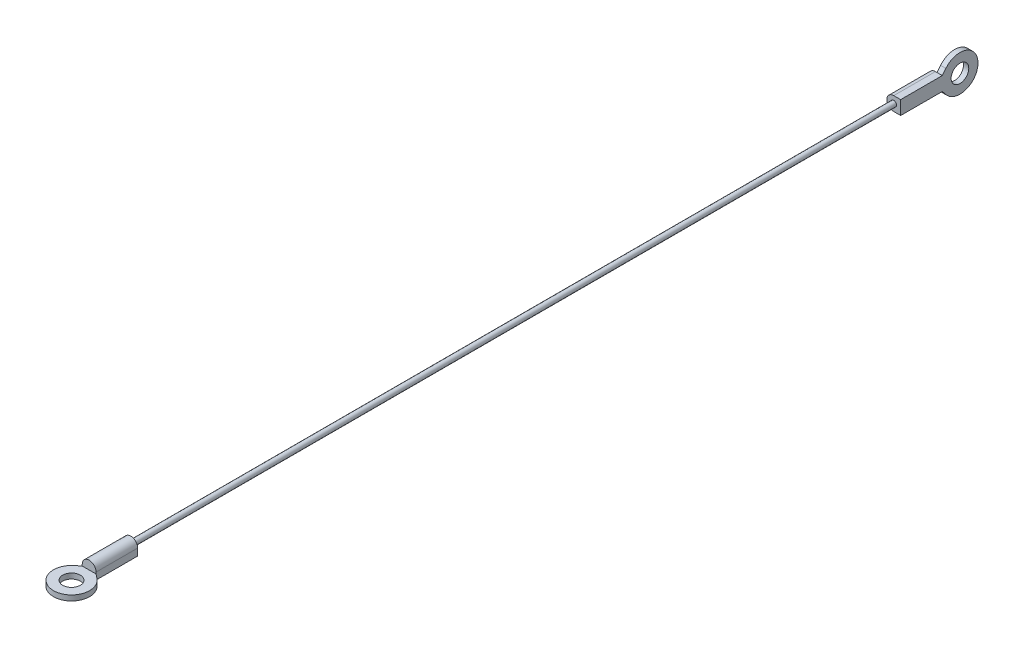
ISO-10303-21;
HEADER;
FILE_DESCRIPTION(('STEP AP214'),'2;1');
FILE_NAME('part.step','',(''),(''),'','','');
FILE_SCHEMA(('AUTOMOTIVE_DESIGN { 1 0 10303 214 1 1 1 1 }'));
ENDSEC;
DATA;
#1=APPLICATION_CONTEXT('core data for automotive mechanical design processes');
#2=APPLICATION_PROTOCOL_DEFINITION('international standard','automotive_design',2000,#1);
#3=PRODUCT_CONTEXT('',#1,'mechanical');
#4=PRODUCT('Part','Part','',(#3));
#5=PRODUCT_RELATED_PRODUCT_CATEGORY('part','',(#4));
#6=PRODUCT_DEFINITION_FORMATION('','',#4);
#7=PRODUCT_DEFINITION_CONTEXT('part definition',#1,'design');
#8=PRODUCT_DEFINITION('design','',#6,#7);
#9=PRODUCT_DEFINITION_SHAPE('','',#8);
#10=(LENGTH_UNIT() NAMED_UNIT(*) SI_UNIT(.MILLI.,.METRE.));
#11=(NAMED_UNIT(*) PLANE_ANGLE_UNIT() SI_UNIT($,.RADIAN.));
#12=(NAMED_UNIT(*) SI_UNIT($,.STERADIAN.) SOLID_ANGLE_UNIT());
#13=UNCERTAINTY_MEASURE_WITH_UNIT(LENGTH_MEASURE(1.E-05),#10,'distance_accuracy_value','');
#14=(GEOMETRIC_REPRESENTATION_CONTEXT(3) GLOBAL_UNCERTAINTY_ASSIGNED_CONTEXT((#13)) GLOBAL_UNIT_ASSIGNED_CONTEXT((#10,
#11,#12)) REPRESENTATION_CONTEXT('',''));
#15=CARTESIAN_POINT('',(0.,0.,0.));
#16=DIRECTION('',(0.,0.,1.));
#17=DIRECTION('',(1.,0.,0.));
#18=AXIS2_PLACEMENT_3D('',#15,#16,#17);
#19=CARTESIAN_POINT('',(0.,0.,-121.92));
#20=DIRECTION('',(0.,0.,-1.));
#21=DIRECTION('',(-1.,0.,0.));
#22=AXIS2_PLACEMENT_3D('',#19,#20,#21);
#23=PLANE('',#22);
#24=DIRECTION('',(1.,0.,0.));
#25=VECTOR('',#24,1.);
#26=CARTESIAN_POINT('',(0.,1.99,-121.92));
#27=LINE('',#26,#25);
#28=CARTESIAN_POINT('',(0.,1.99,-121.92));
#29=VERTEX_POINT('',#28);
#30=CARTESIAN_POINT('',(0.47,1.99,-121.92));
#31=VERTEX_POINT('',#30);
#32=EDGE_CURVE('E196',#29,#31,#27,.T.);
#33=ORIENTED_EDGE('',*,*,#32,.T.);
#34=DIRECTION('',(0.,-1.,0.));
#35=VECTOR('',#34,1.);
#36=CARTESIAN_POINT('',(0.47,-1.99,-121.92));
#37=LINE('',#36,#35);
#38=CARTESIAN_POINT('',(0.47,-1.99,-121.92));
#39=VERTEX_POINT('',#38);
#40=EDGE_CURVE('E154',#31,#39,#37,.T.);
#41=ORIENTED_EDGE('',*,*,#40,.T.);
#42=DIRECTION('',(-1.,0.,0.));
#43=VECTOR('',#42,1.);
#44=CARTESIAN_POINT('',(1.99,-1.99,-121.92));
#45=LINE('',#44,#43);
#46=CARTESIAN_POINT('',(0.,-1.99,-121.92));
#47=VERTEX_POINT('',#46);
#48=EDGE_CURVE('E201',#39,#47,#45,.T.);
#49=ORIENTED_EDGE('',*,*,#48,.T.);
#50=CARTESIAN_POINT('',(0.,0.,-121.92));
#51=DIRECTION('',(0.,0.,-1.));
#52=DIRECTION('',(-1.,0.,0.));
#53=AXIS2_PLACEMENT_3D('',#50,#51,#52);
#54=CIRCLE('',#53,1.99);
#55=EDGE_CURVE('E193',#47,#29,#54,.T.);
#56=ORIENTED_EDGE('',*,*,#55,.T.);
#57=EDGE_LOOP('',(#33,#41,#49,#56));
#58=FACE_BOUND('',#57,.T.);
#59=ADVANCED_FACE('F39',(#58),#23,.T.);
#60=CARTESIAN_POINT('',(0.,0.,121.92));
#61=DIRECTION('',(0.,0.,1.));
#62=DIRECTION('',(1.,0.,0.));
#63=AXIS2_PLACEMENT_3D('',#60,#61,#62);
#64=PLANE('',#63);
#65=DIRECTION('',(0.,-1.,0.));
#66=VECTOR('',#65,1.);
#67=CARTESIAN_POINT('',(-1.99,0.,121.92));
#68=LINE('',#67,#66);
#69=CARTESIAN_POINT('',(-1.99,0.,121.92));
#70=VERTEX_POINT('',#69);
#71=CARTESIAN_POINT('',(-1.99,-0.47,121.92));
#72=VERTEX_POINT('',#71);
#73=EDGE_CURVE('E279',#70,#72,#68,.T.);
#74=ORIENTED_EDGE('',*,*,#73,.T.);
#75=DIRECTION('',(1.,0.,0.));
#76=VECTOR('',#75,1.);
#77=CARTESIAN_POINT('',(-1.99,-0.47,121.92));
#78=LINE('',#77,#76);
#79=CARTESIAN_POINT('',(1.99,-0.47,121.92));
#80=VERTEX_POINT('',#79);
#81=EDGE_CURVE('E240',#72,#80,#78,.T.);
#82=ORIENTED_EDGE('',*,*,#81,.T.);
#83=DIRECTION('',(0.,1.,0.));
#84=VECTOR('',#83,1.);
#85=CARTESIAN_POINT('',(1.99,-1.99,121.92));
#86=LINE('',#85,#84);
#87=CARTESIAN_POINT('',(1.99,0.,121.92));
#88=VERTEX_POINT('',#87);
#89=EDGE_CURVE('E284',#80,#88,#86,.T.);
#90=ORIENTED_EDGE('',*,*,#89,.T.);
#91=CARTESIAN_POINT('',(0.,0.,121.92));
#92=DIRECTION('',(0.,0.,1.));
#93=DIRECTION('',(1.,0.,0.));
#94=AXIS2_PLACEMENT_3D('',#91,#92,#93);
#95=CIRCLE('',#94,1.99);
#96=EDGE_CURVE('E275',#88,#70,#95,.T.);
#97=ORIENTED_EDGE('',*,*,#96,.T.);
#98=EDGE_LOOP('',(#74,#82,#90,#97));
#99=FACE_BOUND('',#98,.T.);
#100=ADVANCED_FACE('F339',(#99),#64,.T.);
#101=CARTESIAN_POINT('',(0.,0.,109.92));
#102=DIRECTION('',(0.,0.,-1.));
#103=DIRECTION('',(-1.,0.,0.));
#104=AXIS2_PLACEMENT_3D('',#101,#102,#103);
#105=CYLINDRICAL_SURFACE('',#104,0.795);
#106=CARTESIAN_POINT('',(0.,0.,109.92));
#107=DIRECTION('',(0.,0.,1.));
#108=DIRECTION('',(1.,0.,0.));
#109=AXIS2_PLACEMENT_3D('',#106,#107,#108);
#110=CIRCLE('',#109,0.795);
#111=CARTESIAN_POINT('',(-0.795,0.,109.92));
#112=VERTEX_POINT('',#111);
#113=EDGE_CURVE('E11',#112,#112,#110,.T.);
#114=CARTESIAN_POINT('',(0.,0.,-109.92));
#115=DIRECTION('',(0.,0.,1.));
#116=DIRECTION('',(1.,0.,0.));
#117=AXIS2_PLACEMENT_3D('',#114,#115,#116);
#118=CIRCLE('',#117,0.795);
#119=CARTESIAN_POINT('',(-0.795,0.,-109.92));
#120=VERTEX_POINT('',#119);
#121=EDGE_CURVE('E43',#120,#120,#118,.T.);
#122=CARTESIAN_POINT('',(-0.795,0.,109.92));
#123=CARTESIAN_POINT('',(-0.795,0.,107.63));
#124=CARTESIAN_POINT('',(-0.795,0.,105.34));
#125=CARTESIAN_POINT('',(-0.795,0.,100.76));
#126=CARTESIAN_POINT('',(-0.795,0.,98.47));
#127=CARTESIAN_POINT('',(-0.795,0.,93.89));
#128=CARTESIAN_POINT('',(-0.795,0.,91.6));
#129=CARTESIAN_POINT('',(-0.795,0.,87.02));
#130=CARTESIAN_POINT('',(-0.795,0.,84.73));
#131=CARTESIAN_POINT('',(-0.795,0.,80.15));
#132=CARTESIAN_POINT('',(-0.795,0.,77.86));
#133=CARTESIAN_POINT('',(-0.795,0.,73.28));
#134=CARTESIAN_POINT('',(-0.795,0.,70.99));
#135=CARTESIAN_POINT('',(-0.795,0.,66.41));
#136=CARTESIAN_POINT('',(-0.795,0.,64.12));
#137=CARTESIAN_POINT('',(-0.795,0.,59.54));
#138=CARTESIAN_POINT('',(-0.795,0.,57.25));
#139=CARTESIAN_POINT('',(-0.795,0.,52.67));
#140=CARTESIAN_POINT('',(-0.795,0.,50.38));
#141=CARTESIAN_POINT('',(-0.795,0.,45.8));
#142=CARTESIAN_POINT('',(-0.795,0.,43.51));
#143=CARTESIAN_POINT('',(-0.795,0.,38.93));
#144=CARTESIAN_POINT('',(-0.795,0.,36.64));
#145=CARTESIAN_POINT('',(-0.795,0.,32.06));
#146=CARTESIAN_POINT('',(-0.795,0.,29.77));
#147=CARTESIAN_POINT('',(-0.795,0.,25.19));
#148=CARTESIAN_POINT('',(-0.795,0.,22.9));
#149=CARTESIAN_POINT('',(-0.795,0.,18.32));
#150=CARTESIAN_POINT('',(-0.795,0.,16.03));
#151=CARTESIAN_POINT('',(-0.795,0.,11.45));
#152=CARTESIAN_POINT('',(-0.795,0.,9.16));
#153=CARTESIAN_POINT('',(-0.795,0.,4.58));
#154=CARTESIAN_POINT('',(-0.795,0.,2.29));
#155=CARTESIAN_POINT('',(-0.795,0.,-2.29));
#156=CARTESIAN_POINT('',(-0.795,0.,-4.58));
#157=CARTESIAN_POINT('',(-0.795,0.,-9.16));
#158=CARTESIAN_POINT('',(-0.795,0.,-11.45));
#159=CARTESIAN_POINT('',(-0.795,0.,-16.03));
#160=CARTESIAN_POINT('',(-0.795,0.,-18.32));
#161=CARTESIAN_POINT('',(-0.795,0.,-22.9));
#162=CARTESIAN_POINT('',(-0.795,0.,-25.19));
#163=CARTESIAN_POINT('',(-0.795,0.,-29.77));
#164=CARTESIAN_POINT('',(-0.795,0.,-32.06));
#165=CARTESIAN_POINT('',(-0.795,0.,-36.64));
#166=CARTESIAN_POINT('',(-0.795,0.,-38.93));
#167=CARTESIAN_POINT('',(-0.795,0.,-43.51));
#168=CARTESIAN_POINT('',(-0.795,0.,-45.8));
#169=CARTESIAN_POINT('',(-0.795,0.,-50.38));
#170=CARTESIAN_POINT('',(-0.795,0.,-52.67));
#171=CARTESIAN_POINT('',(-0.795,0.,-57.25));
#172=CARTESIAN_POINT('',(-0.795,0.,-59.54));
#173=CARTESIAN_POINT('',(-0.795,0.,-64.12));
#174=CARTESIAN_POINT('',(-0.795,0.,-66.41));
#175=CARTESIAN_POINT('',(-0.795,0.,-70.99));
#176=CARTESIAN_POINT('',(-0.795,0.,-73.28));
#177=CARTESIAN_POINT('',(-0.795,0.,-77.86));
#178=CARTESIAN_POINT('',(-0.795,0.,-80.15));
#179=CARTESIAN_POINT('',(-0.795,0.,-84.73));
#180=CARTESIAN_POINT('',(-0.795,0.,-87.02));
#181=CARTESIAN_POINT('',(-0.795,0.,-91.6));
#182=CARTESIAN_POINT('',(-0.795,0.,-93.89));
#183=CARTESIAN_POINT('',(-0.795,0.,-98.47));
#184=CARTESIAN_POINT('',(-0.795,0.,-100.76));
#185=CARTESIAN_POINT('',(-0.795,0.,-105.34));
#186=CARTESIAN_POINT('',(-0.795,0.,-107.63));
#187=CARTESIAN_POINT('',(-0.795,0.,-109.92));
#188=B_SPLINE_CURVE_WITH_KNOTS('',3,(#122,#123,#124,#125,#126,#127,#128,#129,#130,#131,#132,
#133,#134,#135,#136,#137,#138,#139,#140,#141,#142,#143,#144,#145,#146,#147,#148,#149,#150,#151,
#152,#153,#154,#155,#156,#157,#158,#159,#160,#161,#162,#163,#164,#165,#166,#167,#168,#169,#170,
#171,#172,#173,#174,#175,#176,#177,#178,#179,#180,#181,#182,#183,#184,#185,#186,#187),
.UNSPECIFIED.,.F.,.F.,(4,2,2,2,2,2,2,2,2,2,2,2,2,2,2,2,2,2,2,2,2,2,2,2,2,2,2,2,2,2,2,2,4),(0.,
6.87,13.74,20.61,27.48,34.35,41.22,48.09,54.96,61.83,68.7,75.57,82.44,89.31,96.18,103.05,109.92,
116.79,123.66,130.53,137.4,144.27,151.14,158.01,164.88,171.75,178.62,185.49,192.36,199.23,206.1,
212.97,219.84),.UNSPECIFIED.);
#189=EDGE_CURVE('BSEAM41',#112,#120,#188,.T.);
#190=ORIENTED_EDGE('',*,*,#113,.F.);
#191=ORIENTED_EDGE('',*,*,#121,.T.);
#192=ORIENTED_EDGE('',*,*,#189,.T.);
#193=ORIENTED_EDGE('',*,*,#189,.F.);
#194=EDGE_LOOP('',(#190,#192,#191,#193));
#195=FACE_BOUND('',#194,.T.);
#196=ADVANCED_FACE('F41',(#195),#105,.T.);
#197=CARTESIAN_POINT('',(0.,0.,121.92));
#198=DIRECTION('',(0.,0.,-1.));
#199=DIRECTION('',(-1.,0.,0.));
#200=AXIS2_PLACEMENT_3D('',#197,#198,#199);
#201=CYLINDRICAL_SURFACE('',#200,1.99);
#202=CARTESIAN_POINT('',(0.,0.,109.92));
#203=DIRECTION('',(0.,0.,1.));
#204=DIRECTION('',(1.,0.,0.));
#205=AXIS2_PLACEMENT_3D('',#202,#203,#204);
#206=CIRCLE('',#205,1.99);
#207=CARTESIAN_POINT('',(1.99,0.,109.92));
#208=VERTEX_POINT('',#207);
#209=CARTESIAN_POINT('',(-1.99,0.,109.92));
#210=VERTEX_POINT('',#209);
#211=EDGE_CURVE('E269',#208,#210,#206,.T.);
#212=ORIENTED_EDGE('',*,*,#211,.T.);
#213=DIRECTION('',(0.,0.,-1.));
#214=VECTOR('',#213,1.);
#215=CARTESIAN_POINT('',(-1.99,0.,121.92));
#216=LINE('',#215,#214);
#217=EDGE_CURVE('E49',#70,#210,#216,.T.);
#218=ORIENTED_EDGE('',*,*,#217,.F.);
#219=ORIENTED_EDGE('',*,*,#96,.F.);
#220=DIRECTION('',(0.,0.,-1.));
#221=VECTOR('',#220,1.);
#222=CARTESIAN_POINT('',(1.99,0.,121.92));
#223=LINE('',#222,#221);
#224=EDGE_CURVE('E288',#88,#208,#223,.T.);
#225=ORIENTED_EDGE('',*,*,#224,.T.);
#226=EDGE_LOOP('',(#212,#218,#219,#225));
#227=FACE_BOUND('',#226,.T.);
#228=ADVANCED_FACE('F323',(#227),#201,.T.);
#229=CARTESIAN_POINT('',(-1.99,0.,121.92));
#230=DIRECTION('',(1.,0.,0.));
#231=DIRECTION('',(0.,1.,0.));
#232=AXIS2_PLACEMENT_3D('',#229,#230,#231);
#233=PLANE('',#232);
#234=DIRECTION('',(0.,-1.,0.));
#235=VECTOR('',#234,1.);
#236=CARTESIAN_POINT('',(-1.99,0.,109.92));
#237=LINE('',#236,#235);
#238=CARTESIAN_POINT('',(-1.99,-1.99,109.92));
#239=VERTEX_POINT('',#238);
#240=EDGE_CURVE('E292',#210,#239,#237,.T.);
#241=ORIENTED_EDGE('',*,*,#240,.T.);
#242=DIRECTION('',(0.,0.,-1.));
#243=VECTOR('',#242,1.);
#244=CARTESIAN_POINT('',(-1.99,-1.99,121.92));
#245=LINE('',#244,#243);
#246=CARTESIAN_POINT('',(-1.99,-1.99,121.92));
#247=VERTEX_POINT('',#246);
#248=EDGE_CURVE('E308',#247,#239,#245,.T.);
#249=ORIENTED_EDGE('',*,*,#248,.F.);
#250=DIRECTION('',(0.,-1.,0.));
#251=VECTOR('',#250,1.);
#252=CARTESIAN_POINT('',(-1.99,-0.47,121.92));
#253=LINE('',#252,#251);
#254=EDGE_CURVE('E266',#72,#247,#253,.T.);
#255=ORIENTED_EDGE('',*,*,#254,.F.);
#256=ORIENTED_EDGE('',*,*,#73,.F.);
#257=ORIENTED_EDGE('',*,*,#217,.T.);
#258=EDGE_LOOP('',(#241,#249,#255,#256,#257));
#259=FACE_BOUND('',#258,.T.);
#260=ADVANCED_FACE('F317',(#259),#233,.F.);
#261=CARTESIAN_POINT('',(0.,-1.99,121.92));
#262=DIRECTION('',(0.,1.,0.));
#263=DIRECTION('',(0.,0.,1.));
#264=AXIS2_PLACEMENT_3D('',#261,#262,#263);
#265=PLANE('',#264);
#266=DIRECTION('',(1.,0.,0.));
#267=VECTOR('',#266,1.);
#268=CARTESIAN_POINT('',(0.,-1.99,109.92));
#269=LINE('',#268,#267);
#270=CARTESIAN_POINT('',(1.99,-1.99,109.92));
#271=VERTEX_POINT('',#270);
#272=EDGE_CURVE('E296',#239,#271,#269,.T.);
#273=ORIENTED_EDGE('',*,*,#272,.T.);
#274=DIRECTION('',(0.,0.,-1.));
#275=VECTOR('',#274,1.);
#276=CARTESIAN_POINT('',(1.99,-1.99,121.92));
#277=LINE('',#276,#275);
#278=CARTESIAN_POINT('',(1.99,-1.99,121.92));
#279=VERTEX_POINT('',#278);
#280=EDGE_CURVE('E304',#279,#271,#277,.T.);
#281=ORIENTED_EDGE('',*,*,#280,.F.);
#282=DIRECTION('',(0.778962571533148,0.,0.62707042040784));
#283=VECTOR('',#282,1.);
#284=CARTESIAN_POINT('',(1.99,-1.99,121.92));
#285=LINE('',#284,#283);
#286=CARTESIAN_POINT('',(3.26390153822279,-1.99,122.94549981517));
#287=VERTEX_POINT('',#286);
#288=EDGE_CURVE('E235',#279,#287,#285,.T.);
#289=ORIENTED_EDGE('',*,*,#288,.T.);
#290=CARTESIAN_POINT('',(0.,-1.99,127.));
#291=DIRECTION('',(0.,-1.,0.));
#292=DIRECTION('',(0.,0.,-1.));
#293=AXIS2_PLACEMENT_3D('',#290,#291,#292);
#294=CIRCLE('',#293,5.205);
#295=CARTESIAN_POINT('',(-3.26390153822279,-1.99,122.94549981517));
#296=VERTEX_POINT('',#295);
#297=EDGE_CURVE('E259',#287,#296,#294,.T.);
#298=ORIENTED_EDGE('',*,*,#297,.T.);
#299=DIRECTION('',(0.778962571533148,0.,-0.62707042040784));
#300=VECTOR('',#299,1.);
#301=CARTESIAN_POINT('',(-3.26390153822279,-1.99,122.94549981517));
#302=LINE('',#301,#300);
#303=EDGE_CURVE('E244',#296,#247,#302,.T.);
#304=ORIENTED_EDGE('',*,*,#303,.T.);
#305=ORIENTED_EDGE('',*,*,#248,.T.);
#306=EDGE_LOOP('',(#273,#281,#289,#298,#304,#305));
#307=FACE_BOUND('',#306,.T.);
#308=CARTESIAN_POINT('',(0.,-1.99,127.));
#309=DIRECTION('',(0.,-1.,0.));
#310=DIRECTION('',(0.,0.,-1.));
#311=AXIS2_PLACEMENT_3D('',#308,#309,#310);
#312=CIRCLE('',#311,2.54);
#313=CARTESIAN_POINT('',(0.,-1.99,124.46));
#314=VERTEX_POINT('',#313);
#315=EDGE_CURVE('E236',#314,#314,#312,.T.);
#316=ORIENTED_EDGE('',*,*,#315,.F.);
#317=EDGE_LOOP('',(#316));
#318=FACE_BOUND('',#317,.T.);
#319=ADVANCED_FACE('F330',(#307,#318),#265,.F.);
#320=CARTESIAN_POINT('',(1.99,-1.99,121.92));
#321=DIRECTION('',(-1.,0.,0.));
#322=DIRECTION('',(0.,-1.,0.));
#323=AXIS2_PLACEMENT_3D('',#320,#321,#322);
#324=PLANE('',#323);
#325=DIRECTION('',(0.,1.,0.));
#326=VECTOR('',#325,1.);
#327=CARTESIAN_POINT('',(1.99,-1.99,109.92));
#328=LINE('',#327,#326);
#329=EDGE_CURVE('E280',#271,#208,#328,.T.);
#330=ORIENTED_EDGE('',*,*,#329,.T.);
#331=ORIENTED_EDGE('',*,*,#224,.F.);
#332=ORIENTED_EDGE('',*,*,#89,.F.);
#333=EDGE_CURVE('E285',#279,#80,#86,.T.);
#334=ORIENTED_EDGE('',*,*,#333,.F.);
#335=ORIENTED_EDGE('',*,*,#280,.T.);
#336=EDGE_LOOP('',(#330,#331,#332,#334,#335));
#337=FACE_BOUND('',#336,.T.);
#338=ADVANCED_FACE('F334',(#337),#324,.F.);
#339=CARTESIAN_POINT('',(0.,0.,109.92));
#340=DIRECTION('',(0.,0.,1.));
#341=DIRECTION('',(1.,0.,0.));
#342=AXIS2_PLACEMENT_3D('',#339,#340,#341);
#343=PLANE('',#342);
#344=ORIENTED_EDGE('',*,*,#113,.T.);
#345=EDGE_LOOP('',(#344));
#346=FACE_BOUND('',#345,.T.);
#347=ORIENTED_EDGE('',*,*,#211,.F.);
#348=ORIENTED_EDGE('',*,*,#329,.F.);
#349=ORIENTED_EDGE('',*,*,#272,.F.);
#350=ORIENTED_EDGE('',*,*,#240,.F.);
#351=EDGE_LOOP('',(#347,#348,#349,#350));
#352=FACE_BOUND('',#351,.T.);
#353=ADVANCED_FACE('F327',(#346,#352),#343,.F.);
#354=CARTESIAN_POINT('',(-3.26390153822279,-0.47,122.94549981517));
#355=DIRECTION('',(-0.62707042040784,0.,-0.778962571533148));
#356=DIRECTION('',(-0.778962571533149,0.,0.62707042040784));
#357=AXIS2_PLACEMENT_3D('',#354,#355,#356);
#358=PLANE('',#357);
#359=ORIENTED_EDGE('',*,*,#303,.F.);
#360=DIRECTION('',(0.,-1.,0.));
#361=VECTOR('',#360,1.);
#362=CARTESIAN_POINT('',(-3.26390153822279,-0.47,122.94549981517));
#363=LINE('',#362,#361);
#364=CARTESIAN_POINT('',(-3.26390153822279,-0.47,122.94549981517));
#365=VERTEX_POINT('',#364);
#366=EDGE_CURVE('E270',#365,#296,#363,.T.);
#367=ORIENTED_EDGE('',*,*,#366,.F.);
#368=DIRECTION('',(0.778962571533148,0.,-0.62707042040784));
#369=VECTOR('',#368,1.);
#370=CARTESIAN_POINT('',(-3.26390153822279,-0.47,122.94549981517));
#371=LINE('',#370,#369);
#372=EDGE_CURVE('E251',#365,#72,#371,.T.);
#373=ORIENTED_EDGE('',*,*,#372,.T.);
#374=ORIENTED_EDGE('',*,*,#254,.T.);
#375=EDGE_LOOP('',(#359,#367,#373,#374));
#376=FACE_BOUND('',#375,.T.);
#377=ADVANCED_FACE('F344',(#376),#358,.T.);
#378=CARTESIAN_POINT('',(0.,-0.47,127.));
#379=DIRECTION('',(0.,-1.,0.));
#380=DIRECTION('',(0.,0.,-1.));
#381=AXIS2_PLACEMENT_3D('',#378,#379,#380);
#382=CYLINDRICAL_SURFACE('',#381,5.205);
#383=ORIENTED_EDGE('',*,*,#297,.F.);
#384=DIRECTION('',(0.,-1.,0.));
#385=VECTOR('',#384,1.);
#386=CARTESIAN_POINT('',(3.26390153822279,-0.47,122.94549981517));
#387=LINE('',#386,#385);
#388=CARTESIAN_POINT('',(3.26390153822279,-0.47,122.94549981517));
#389=VERTEX_POINT('',#388);
#390=EDGE_CURVE('E255',#389,#287,#387,.T.);
#391=ORIENTED_EDGE('',*,*,#390,.F.);
#392=CARTESIAN_POINT('',(0.,-0.47,127.));
#393=DIRECTION('',(0.,-1.,0.));
#394=DIRECTION('',(0.,0.,-1.));
#395=AXIS2_PLACEMENT_3D('',#392,#393,#394);
#396=CIRCLE('',#395,5.205);
#397=EDGE_CURVE('E247',#389,#365,#396,.T.);
#398=ORIENTED_EDGE('',*,*,#397,.T.);
#399=ORIENTED_EDGE('',*,*,#366,.T.);
#400=EDGE_LOOP('',(#383,#391,#398,#399));
#401=FACE_BOUND('',#400,.T.);
#402=ADVANCED_FACE('F347',(#401),#382,.T.);
#403=CARTESIAN_POINT('',(1.99,-0.47,121.92));
#404=DIRECTION('',(0.62707042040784,0.,-0.778962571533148));
#405=DIRECTION('',(-0.778962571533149,0.,-0.62707042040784));
#406=AXIS2_PLACEMENT_3D('',#403,#404,#405);
#407=PLANE('',#406);
#408=ORIENTED_EDGE('',*,*,#288,.F.);
#409=ORIENTED_EDGE('',*,*,#333,.T.);
#410=DIRECTION('',(0.778962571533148,0.,0.62707042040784));
#411=VECTOR('',#410,1.);
#412=CARTESIAN_POINT('',(1.99,-0.47,121.92));
#413=LINE('',#412,#411);
#414=EDGE_CURVE('E64',#80,#389,#413,.T.);
#415=ORIENTED_EDGE('',*,*,#414,.T.);
#416=ORIENTED_EDGE('',*,*,#390,.T.);
#417=EDGE_LOOP('',(#408,#409,#415,#416));
#418=FACE_BOUND('',#417,.T.);
#419=ADVANCED_FACE('F337',(#418),#407,.T.);
#420=CARTESIAN_POINT('',(0.,-0.47,127.));
#421=DIRECTION('',(0.,-1.,0.));
#422=DIRECTION('',(0.,0.,-1.));
#423=AXIS2_PLACEMENT_3D('',#420,#421,#422);
#424=PLANE('',#423);
#425=CARTESIAN_POINT('',(0.,-0.47,127.));
#426=DIRECTION('',(0.,-1.,0.));
#427=DIRECTION('',(0.,0.,-1.));
#428=AXIS2_PLACEMENT_3D('',#425,#426,#427);
#429=CIRCLE('',#428,2.54);
#430=CARTESIAN_POINT('',(0.,-0.47,124.46));
#431=VERTEX_POINT('',#430);
#432=EDGE_CURVE('E231',#431,#431,#429,.T.);
#433=ORIENTED_EDGE('',*,*,#432,.T.);
#434=EDGE_LOOP('',(#433));
#435=FACE_BOUND('',#434,.T.);
#436=ORIENTED_EDGE('',*,*,#81,.F.);
#437=ORIENTED_EDGE('',*,*,#372,.F.);
#438=ORIENTED_EDGE('',*,*,#397,.F.);
#439=ORIENTED_EDGE('',*,*,#414,.F.);
#440=EDGE_LOOP('',(#436,#437,#438,#439));
#441=FACE_BOUND('',#440,.T.);
#442=ADVANCED_FACE('F341',(#435,#441),#424,.F.);
#443=CARTESIAN_POINT('',(0.,-0.47,127.));
#444=DIRECTION('',(0.,-1.,0.));
#445=DIRECTION('',(0.,0.,-1.));
#446=AXIS2_PLACEMENT_3D('',#443,#444,#445);
#447=CYLINDRICAL_SURFACE('',#446,2.54);
#448=ORIENTED_EDGE('',*,*,#432,.F.);
#449=EDGE_LOOP('',(#448));
#450=FACE_BOUND('',#449,.T.);
#451=ORIENTED_EDGE('',*,*,#315,.T.);
#452=EDGE_LOOP('',(#451));
#453=FACE_BOUND('',#452,.T.);
#454=ADVANCED_FACE('F385',(#450,#453),#447,.F.);
#455=CARTESIAN_POINT('',(0.,0.,-121.92));
#456=DIRECTION('',(0.,0.,1.));
#457=DIRECTION('',(1.,0.,0.));
#458=AXIS2_PLACEMENT_3D('',#455,#456,#457);
#459=CYLINDRICAL_SURFACE('',#458,1.99);
#460=CARTESIAN_POINT('',(0.,0.,-109.92));
#461=DIRECTION('',(0.,0.,-1.));
#462=DIRECTION('',(-1.,0.,0.));
#463=AXIS2_PLACEMENT_3D('',#460,#461,#462);
#464=CIRCLE('',#463,1.99);
#465=CARTESIAN_POINT('',(0.,-1.99,-109.92));
#466=VERTEX_POINT('',#465);
#467=CARTESIAN_POINT('',(0.,1.99,-109.92));
#468=VERTEX_POINT('',#467);
#469=EDGE_CURVE('E190',#466,#468,#464,.T.);
#470=ORIENTED_EDGE('',*,*,#469,.T.);
#471=DIRECTION('',(0.,0.,1.));
#472=VECTOR('',#471,1.);
#473=CARTESIAN_POINT('',(0.,1.99,-121.92));
#474=LINE('',#473,#472);
#475=EDGE_CURVE('E228',#29,#468,#474,.T.);
#476=ORIENTED_EDGE('',*,*,#475,.F.);
#477=ORIENTED_EDGE('',*,*,#55,.F.);
#478=DIRECTION('',(0.,0.,1.));
#479=VECTOR('',#478,1.);
#480=CARTESIAN_POINT('',(0.,-1.99,-121.92));
#481=LINE('',#480,#479);
#482=EDGE_CURVE('E204',#47,#466,#481,.T.);
#483=ORIENTED_EDGE('',*,*,#482,.T.);
#484=EDGE_LOOP('',(#470,#476,#477,#483));
#485=FACE_BOUND('',#484,.T.);
#486=ADVANCED_FACE('F381',(#485),#459,.T.);
#487=CARTESIAN_POINT('',(0.,1.99,-121.92));
#488=DIRECTION('',(0.,-1.,0.));
#489=DIRECTION('',(0.,0.,-1.));
#490=AXIS2_PLACEMENT_3D('',#487,#488,#489);
#491=PLANE('',#490);
#492=DIRECTION('',(1.,0.,0.));
#493=VECTOR('',#492,1.);
#494=CARTESIAN_POINT('',(0.,1.99,-109.92));
#495=LINE('',#494,#493);
#496=CARTESIAN_POINT('',(1.99,1.99,-109.92));
#497=VERTEX_POINT('',#496);
#498=EDGE_CURVE('E208',#468,#497,#495,.T.);
#499=ORIENTED_EDGE('',*,*,#498,.T.);
#500=DIRECTION('',(0.,0.,1.));
#501=VECTOR('',#500,1.);
#502=CARTESIAN_POINT('',(1.99,1.99,-121.92));
#503=LINE('',#502,#501);
#504=CARTESIAN_POINT('',(1.99,1.99,-121.92));
#505=VERTEX_POINT('',#504);
#506=EDGE_CURVE('E224',#505,#497,#503,.T.);
#507=ORIENTED_EDGE('',*,*,#506,.F.);
#508=DIRECTION('',(1.,0.,0.));
#509=VECTOR('',#508,1.);
#510=CARTESIAN_POINT('',(0.47,1.99,-121.92));
#511=LINE('',#510,#509);
#512=EDGE_CURVE('E187',#31,#505,#511,.T.);
#513=ORIENTED_EDGE('',*,*,#512,.F.);
#514=ORIENTED_EDGE('',*,*,#32,.F.);
#515=ORIENTED_EDGE('',*,*,#475,.T.);
#516=EDGE_LOOP('',(#499,#507,#513,#514,#515));
#517=FACE_BOUND('',#516,.T.);
#518=ADVANCED_FACE('F377',(#517),#491,.F.);
#519=CARTESIAN_POINT('',(1.99,0.,-121.92));
#520=DIRECTION('',(-1.,0.,0.));
#521=DIRECTION('',(0.,-1.,0.));
#522=AXIS2_PLACEMENT_3D('',#519,#520,#521);
#523=PLANE('',#522);
#524=DIRECTION('',(0.,-1.,0.));
#525=VECTOR('',#524,1.);
#526=CARTESIAN_POINT('',(1.99,0.,-109.92));
#527=LINE('',#526,#525);
#528=CARTESIAN_POINT('',(1.99,-1.99,-109.92));
#529=VERTEX_POINT('',#528);
#530=EDGE_CURVE('E212',#497,#529,#527,.T.);
#531=ORIENTED_EDGE('',*,*,#530,.T.);
#532=DIRECTION('',(0.,0.,1.));
#533=VECTOR('',#532,1.);
#534=CARTESIAN_POINT('',(1.99,-1.99,-121.92));
#535=LINE('',#534,#533);
#536=CARTESIAN_POINT('',(1.99,-1.99,-121.92));
#537=VERTEX_POINT('',#536);
#538=EDGE_CURVE('E220',#537,#529,#535,.T.);
#539=ORIENTED_EDGE('',*,*,#538,.F.);
#540=DIRECTION('',(0.,-0.778962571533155,-0.627070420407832));
#541=VECTOR('',#540,1.);
#542=CARTESIAN_POINT('',(1.99,-3.2639015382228,-122.94549981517));
#543=LINE('',#542,#541);
#544=CARTESIAN_POINT('',(1.99,-3.2639015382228,-122.94549981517));
#545=VERTEX_POINT('',#544);
#546=EDGE_CURVE('E181',#537,#545,#543,.T.);
#547=ORIENTED_EDGE('',*,*,#546,.T.);
#548=CARTESIAN_POINT('',(1.99,0.,-127.));
#549=DIRECTION('',(1.,0.,0.));
#550=DIRECTION('',(0.,0.,1.));
#551=AXIS2_PLACEMENT_3D('',#548,#549,#550);
#552=CIRCLE('',#551,5.20500000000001);
#553=CARTESIAN_POINT('',(1.99,3.2639015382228,-122.94549981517));
#554=VERTEX_POINT('',#553);
#555=EDGE_CURVE('E149',#545,#554,#552,.T.);
#556=ORIENTED_EDGE('',*,*,#555,.T.);
#557=DIRECTION('',(0.,-0.778962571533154,0.627070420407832));
#558=VECTOR('',#557,1.);
#559=CARTESIAN_POINT('',(1.99,1.99,-121.92));
#560=LINE('',#559,#558);
#561=EDGE_CURVE('E166',#554,#505,#560,.T.);
#562=ORIENTED_EDGE('',*,*,#561,.T.);
#563=ORIENTED_EDGE('',*,*,#506,.T.);
#564=EDGE_LOOP('',(#531,#539,#547,#556,#562,#563));
#565=FACE_BOUND('',#564,.T.);
#566=CARTESIAN_POINT('',(1.99,0.,-127.));
#567=DIRECTION('',(1.,0.,0.));
#568=DIRECTION('',(0.,0.,-1.));
#569=AXIS2_PLACEMENT_3D('',#566,#567,#568);
#570=CIRCLE('',#569,2.53999999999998);
#571=CARTESIAN_POINT('',(1.99,0.,-129.54));
#572=VERTEX_POINT('',#571);
#573=EDGE_CURVE('E174',#572,#572,#570,.T.);
#574=ORIENTED_EDGE('',*,*,#573,.F.);
#575=EDGE_LOOP('',(#574));
#576=FACE_BOUND('',#575,.T.);
#577=ADVANCED_FACE('F373',(#565,#576),#523,.F.);
#578=CARTESIAN_POINT('',(1.99,-1.99,-121.92));
#579=DIRECTION('',(0.,1.,0.));
#580=DIRECTION('',(0.,0.,1.));
#581=AXIS2_PLACEMENT_3D('',#578,#579,#580);
#582=PLANE('',#581);
#583=DIRECTION('',(-1.,0.,0.));
#584=VECTOR('',#583,1.);
#585=CARTESIAN_POINT('',(1.99,-1.99,-109.92));
#586=LINE('',#585,#584);
#587=EDGE_CURVE('E197',#529,#466,#586,.T.);
#588=ORIENTED_EDGE('',*,*,#587,.T.);
#589=ORIENTED_EDGE('',*,*,#482,.F.);
#590=ORIENTED_EDGE('',*,*,#48,.F.);
#591=EDGE_CURVE('E163',#537,#39,#45,.T.);
#592=ORIENTED_EDGE('',*,*,#591,.F.);
#593=ORIENTED_EDGE('',*,*,#538,.T.);
#594=EDGE_LOOP('',(#588,#589,#590,#592,#593));
#595=FACE_BOUND('',#594,.T.);
#596=ADVANCED_FACE('F369',(#595),#582,.F.);
#597=CARTESIAN_POINT('',(0.,0.,-109.92));
#598=DIRECTION('',(0.,0.,-1.));
#599=DIRECTION('',(-1.,0.,0.));
#600=AXIS2_PLACEMENT_3D('',#597,#598,#599);
#601=PLANE('',#600);
#602=ORIENTED_EDGE('',*,*,#121,.F.);
#603=EDGE_LOOP('',(#602));
#604=FACE_BOUND('',#603,.T.);
#605=ORIENTED_EDGE('',*,*,#469,.F.);
#606=ORIENTED_EDGE('',*,*,#587,.F.);
#607=ORIENTED_EDGE('',*,*,#530,.F.);
#608=ORIENTED_EDGE('',*,*,#498,.F.);
#609=EDGE_LOOP('',(#605,#606,#607,#608));
#610=FACE_BOUND('',#609,.T.);
#611=ADVANCED_FACE('F366',(#604,#610),#601,.F.);
#612=CARTESIAN_POINT('',(0.47,-3.2639015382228,-122.94549981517));
#613=DIRECTION('',(0.,-0.627070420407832,0.778962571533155));
#614=DIRECTION('',(0.,-0.778962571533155,-0.627070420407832));
#615=AXIS2_PLACEMENT_3D('',#612,#613,#614);
#616=PLANE('',#615);
#617=ORIENTED_EDGE('',*,*,#546,.F.);
#618=ORIENTED_EDGE('',*,*,#591,.T.);
#619=DIRECTION('',(0.,-0.778962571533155,-0.627070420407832));
#620=VECTOR('',#619,1.);
#621=CARTESIAN_POINT('',(0.47,-3.2639015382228,-122.94549981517));
#622=LINE('',#621,#620);
#623=CARTESIAN_POINT('',(0.47,-3.2639015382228,-122.94549981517));
#624=VERTEX_POINT('',#623);
#625=EDGE_CURVE('E56',#39,#624,#622,.T.);
#626=ORIENTED_EDGE('',*,*,#625,.T.);
#627=DIRECTION('',(1.,0.,0.));
#628=VECTOR('',#627,1.);
#629=CARTESIAN_POINT('',(0.47,-3.2639015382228,-122.94549981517));
#630=LINE('',#629,#628);
#631=EDGE_CURVE('E145',#624,#545,#630,.T.);
#632=ORIENTED_EDGE('',*,*,#631,.T.);
#633=EDGE_LOOP('',(#617,#618,#626,#632));
#634=FACE_BOUND('',#633,.T.);
#635=ADVANCED_FACE('F161',(#634),#616,.T.);
#636=CARTESIAN_POINT('',(0.47,1.99,-121.92));
#637=DIRECTION('',(0.,0.627070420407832,0.778962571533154));
#638=DIRECTION('',(0.,-0.778962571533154,0.627070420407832));
#639=AXIS2_PLACEMENT_3D('',#636,#637,#638);
#640=PLANE('',#639);
#641=ORIENTED_EDGE('',*,*,#561,.F.);
#642=DIRECTION('',(1.,0.,0.));
#643=VECTOR('',#642,1.);
#644=CARTESIAN_POINT('',(0.47,3.2639015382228,-122.94549981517));
#645=LINE('',#644,#643);
#646=CARTESIAN_POINT('',(0.47,3.2639015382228,-122.94549981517));
#647=VERTEX_POINT('',#646);
#648=EDGE_CURVE('E153',#647,#554,#645,.T.);
#649=ORIENTED_EDGE('',*,*,#648,.F.);
#650=DIRECTION('',(0.,-0.778962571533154,0.627070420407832));
#651=VECTOR('',#650,1.);
#652=CARTESIAN_POINT('',(0.47,1.99,-121.92));
#653=LINE('',#652,#651);
#654=EDGE_CURVE('E158',#647,#31,#653,.T.);
#655=ORIENTED_EDGE('',*,*,#654,.T.);
#656=ORIENTED_EDGE('',*,*,#512,.T.);
#657=EDGE_LOOP('',(#641,#649,#655,#656));
#658=FACE_BOUND('',#657,.T.);
#659=ADVANCED_FACE('F431',(#658),#640,.T.);
#660=CARTESIAN_POINT('',(0.47,0.,-127.));
#661=DIRECTION('',(1.,0.,0.));
#662=DIRECTION('',(0.,0.,-1.));
#663=AXIS2_PLACEMENT_3D('',#660,#661,#662);
#664=CYLINDRICAL_SURFACE('',#663,5.20500000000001);
#665=ORIENTED_EDGE('',*,*,#555,.F.);
#666=ORIENTED_EDGE('',*,*,#631,.F.);
#667=CARTESIAN_POINT('',(0.47,0.,-127.));
#668=DIRECTION('',(1.,0.,0.));
#669=DIRECTION('',(0.,0.,1.));
#670=AXIS2_PLACEMENT_3D('',#667,#668,#669);
#671=CIRCLE('',#670,5.20500000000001);
#672=EDGE_CURVE('E147',#624,#647,#671,.T.);
#673=ORIENTED_EDGE('',*,*,#672,.T.);
#674=ORIENTED_EDGE('',*,*,#648,.T.);
#675=EDGE_LOOP('',(#665,#666,#673,#674));
#676=FACE_BOUND('',#675,.T.);
#677=ADVANCED_FACE('F146',(#676),#664,.T.);
#678=CARTESIAN_POINT('',(0.47,0.,-127.));
#679=DIRECTION('',(-1.,0.,0.));
#680=DIRECTION('',(0.,0.,1.));
#681=AXIS2_PLACEMENT_3D('',#678,#679,#680);
#682=PLANE('',#681);
#683=CARTESIAN_POINT('',(0.47,0.,-127.));
#684=DIRECTION('',(1.,0.,0.));
#685=DIRECTION('',(0.,0.,-1.));
#686=AXIS2_PLACEMENT_3D('',#683,#684,#685);
#687=CIRCLE('',#686,2.53999999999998);
#688=CARTESIAN_POINT('',(0.47,0.,-129.54));
#689=VERTEX_POINT('',#688);
#690=EDGE_CURVE('E184',#689,#689,#687,.T.);
#691=ORIENTED_EDGE('',*,*,#690,.T.);
#692=EDGE_LOOP('',(#691));
#693=FACE_BOUND('',#692,.T.);
#694=ORIENTED_EDGE('',*,*,#625,.F.);
#695=ORIENTED_EDGE('',*,*,#40,.F.);
#696=ORIENTED_EDGE('',*,*,#654,.F.);
#697=ORIENTED_EDGE('',*,*,#672,.F.);
#698=EDGE_LOOP('',(#694,#695,#696,#697));
#699=FACE_BOUND('',#698,.T.);
#700=ADVANCED_FACE('F157',(#693,#699),#682,.T.);
#701=CARTESIAN_POINT('',(0.47,0.,-127.));
#702=DIRECTION('',(1.,0.,0.));
#703=DIRECTION('',(0.,0.,-1.));
#704=AXIS2_PLACEMENT_3D('',#701,#702,#703);
#705=CYLINDRICAL_SURFACE('',#704,2.53999999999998);
#706=ORIENTED_EDGE('',*,*,#690,.F.);
#707=EDGE_LOOP('',(#706));
#708=FACE_BOUND('',#707,.T.);
#709=ORIENTED_EDGE('',*,*,#573,.T.);
#710=EDGE_LOOP('',(#709));
#711=FACE_BOUND('',#710,.T.);
#712=ADVANCED_FACE('F439',(#708,#711),#705,.F.);
#713=CLOSED_SHELL('',(#59,#100,#196,#228,#260,#319,#338,#353,#377,#402,#419,#442,#454,#486,#518,
#577,#596,#611,#635,#659,#677,#700,#712));
#714=MANIFOLD_SOLID_BREP('B2',#713);
#715=ADVANCED_BREP_SHAPE_REPRESENTATION('',(#18,#714),#14);
#716=SHAPE_DEFINITION_REPRESENTATION(#9,#715);
ENDSEC;
END-ISO-10303-21;
